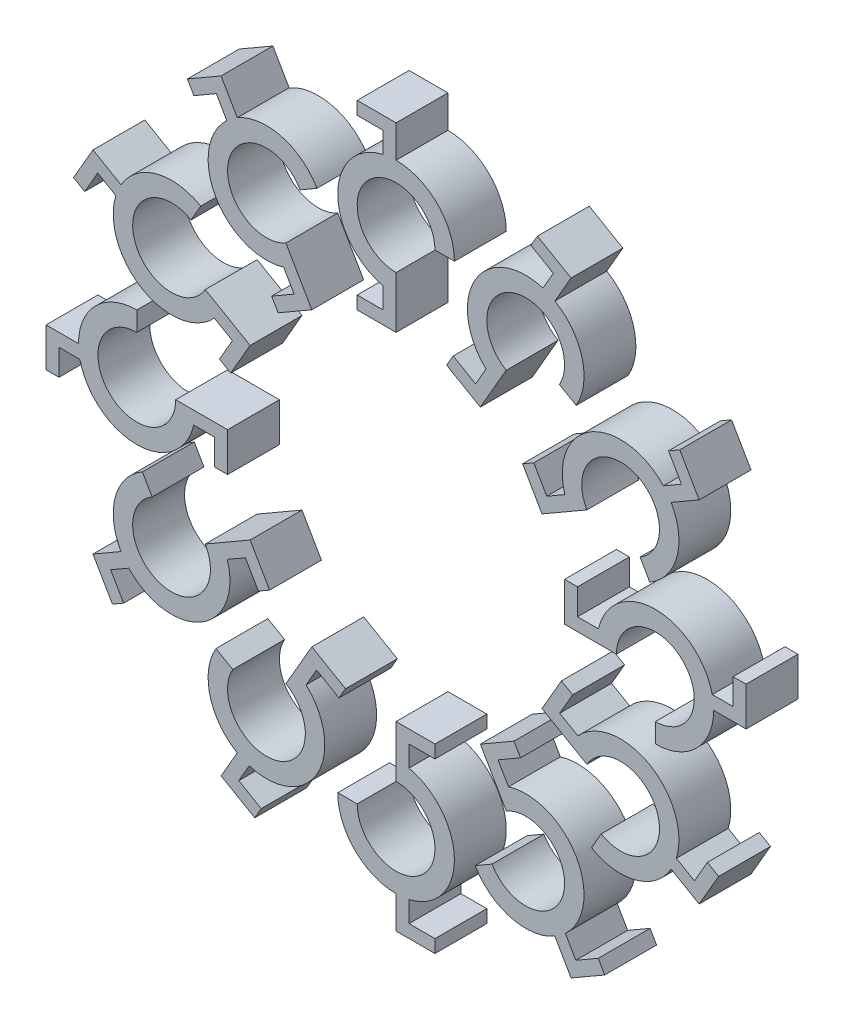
from build123d import *

# Parameters (mm, degrees)
SKETCH_1_R            = 4.5
SKETCH_1_R_2          = 3
EXTRUDE_1_DEPTH       = 4
SKETCH_2_W            = 4.5
SKETCH_2_H            = 4.5
CUT_EXTRUDE_1_DEPTH   = 8.516648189
SKETCH_3_W            = 1
SKETCH_3_H            = 2
EXTRUDE_3_DEPTH       = 4
SKETCH_4_W            = 1
SKETCH_4_H            = 2
EXTRUDE_4_DEPTH       = 4
PATTERN_CURVE_1_COUNT = 12


with BuildPart() as part:
    # Sketch 1 → Extrude 1 (new body)
    with BuildSketch(Plane.XY):
        Circle(SKETCH_1_R)
        Circle(SKETCH_1_R_2, mode=Mode.SUBTRACT)
    extrude(amount=EXTRUDE_1_DEPTH)

    # Sketch 2 → Cut-Extrude 1 (cut, through all)
    with BuildSketch(Plane.XY.offset(4)):
        with Locations((2.25, 2.25)):
            Rectangle(SKETCH_2_W, SKETCH_2_H)
    extrude(amount=-CUT_EXTRUDE_1_DEPTH, mode=Mode.SUBTRACT)

    # Sketch 3 → Extrude 3 (add, through all)
    with BuildSketch(Plane.XY.offset(4)):
        with BuildLine():
            Line((7, 0), (4.5, 0))
            ThreePointArc((4.5, 0), (4.471782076, -0.503155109), (4.387482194, -1))
            Line((4.387482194, -1), (6, -1))
            Line((6, -1), (7, -1))
            Line((7, -1), (7, 0))
        make_face()
        with Locations((6.5, -2)):
            Rectangle(SKETCH_3_W, SKETCH_3_H)
    extrude(amount=-EXTRUDE_3_DEPTH)

    # Sketch 4 → Extrude 4 (add, through all)
    with BuildSketch(Plane.XY.offset(4)):
        with BuildLine():
            ThreePointArc((-4.387482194, -1), (-4.471782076, -0.503155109), (-4.5, 0))
            Line((-4.5, 0), (-7, 0))
            Line((-7, 0), (-7, -1))
            Line((-7, -1), (-6, -1))
            Line((-6, -1), (-4.387482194, -1))
        make_face()
        with Locations((-6.5, -2)):
            Rectangle(SKETCH_4_W, SKETCH_4_H)
    extrude(amount=-EXTRUDE_4_DEPTH)


with BuildPart() as pattern_curve_1_1:
    # Pattern Curve 1: pattern copy
    add(part.part.rotate(Axis((20, 0, 4), (0, 0, 1)), 1 * 360 / PATTERN_CURVE_1_COUNT))


with BuildPart() as pattern_curve_1_2:
    # Pattern Curve 1: pattern copy
    add(part.part.rotate(Axis((20, 0, 4), (0, 0, 1)), 2 * 360 / PATTERN_CURVE_1_COUNT))


with BuildPart() as pattern_curve_1_3:
    # Pattern Curve 1: pattern copy
    add(part.part.rotate(Axis((20, 0, 4), (0, 0, 1)), 3 * 360 / PATTERN_CURVE_1_COUNT))


with BuildPart() as pattern_curve_1_4:
    # Pattern Curve 1: pattern copy
    add(part.part.rotate(Axis((20, 0, 4), (0, 0, 1)), 4 * 360 / PATTERN_CURVE_1_COUNT))


with BuildPart() as pattern_curve_1_5:
    # Pattern Curve 1: pattern copy
    add(part.part.rotate(Axis((20, 0, 4), (0, 0, 1)), 5 * 360 / PATTERN_CURVE_1_COUNT))


with BuildPart() as pattern_curve_1_6:
    # Pattern Curve 1: pattern copy
    add(part.part.rotate(Axis((20, 0, 4), (0, 0, 1)), 6 * 360 / PATTERN_CURVE_1_COUNT))


with BuildPart() as pattern_curve_1_7:
    # Pattern Curve 1: pattern copy
    add(part.part.rotate(Axis((20, 0, 4), (0, 0, 1)), 7 * 360 / PATTERN_CURVE_1_COUNT))


with BuildPart() as pattern_curve_1_8:
    # Pattern Curve 1: pattern copy
    add(part.part.rotate(Axis((20, 0, 4), (0, 0, 1)), 8 * 360 / PATTERN_CURVE_1_COUNT))


with BuildPart() as pattern_curve_1_9:
    # Pattern Curve 1: pattern copy
    add(part.part.rotate(Axis((20, 0, 4), (0, 0, 1)), 9 * 360 / PATTERN_CURVE_1_COUNT))


with BuildPart() as pattern_curve_1_10:
    # Pattern Curve 1: pattern copy
    add(part.part.rotate(Axis((20, 0, 4), (0, 0, 1)), 10 * 360 / PATTERN_CURVE_1_COUNT))


with BuildPart() as pattern_curve_1_11:
    # Pattern Curve 1: pattern copy
    add(part.part.rotate(Axis((20, 0, 4), (0, 0, 1)), 11 * 360 / PATTERN_CURVE_1_COUNT))


solid = Compound([part.part, pattern_curve_1_1.part, pattern_curve_1_2.part, pattern_curve_1_3.part, pattern_curve_1_4.part, pattern_curve_1_5.part, pattern_curve_1_6.part, pattern_curve_1_7.part, pattern_curve_1_8.part, pattern_curve_1_9.part, pattern_curve_1_10.part, pattern_curve_1_11.part])
